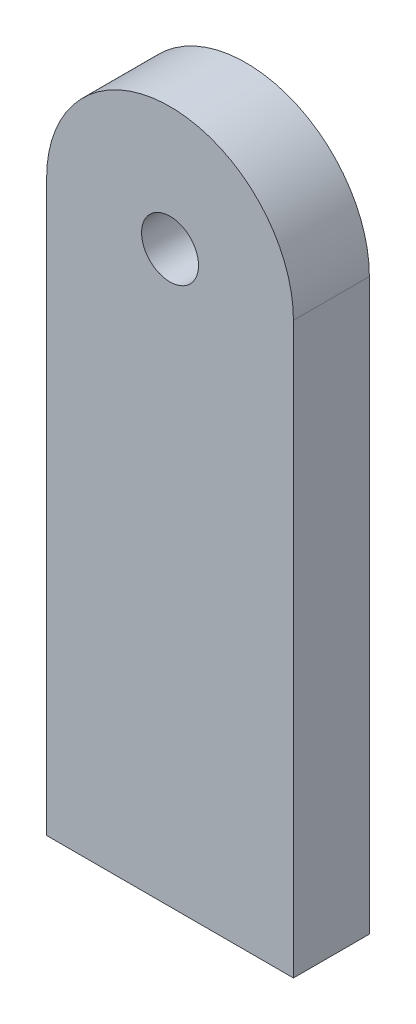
from build123d import *

# Parameters (mm, degrees)
SKETCH1_R      = 3.81
EXTRUDE1_DEPTH = 5.08


with BuildPart() as part:
    # Sketch1 → Extrude1 (new, symmetric)
    with BuildSketch(Plane.XY):
        with BuildLine():
            Line((-16.51, 0), (-16.51, -76.2))
            Line((-16.51, -76.2), (16.51, -76.2))
            Line((16.51, -76.2), (16.51, 0))
            ThreePointArc((16.51, 0), (0, 16.51), (-16.51, 0))
        make_face()
        Circle(SKETCH1_R, mode=Mode.SUBTRACT)
    extrude(amount=EXTRUDE1_DEPTH, both=True)


solid = part.part
